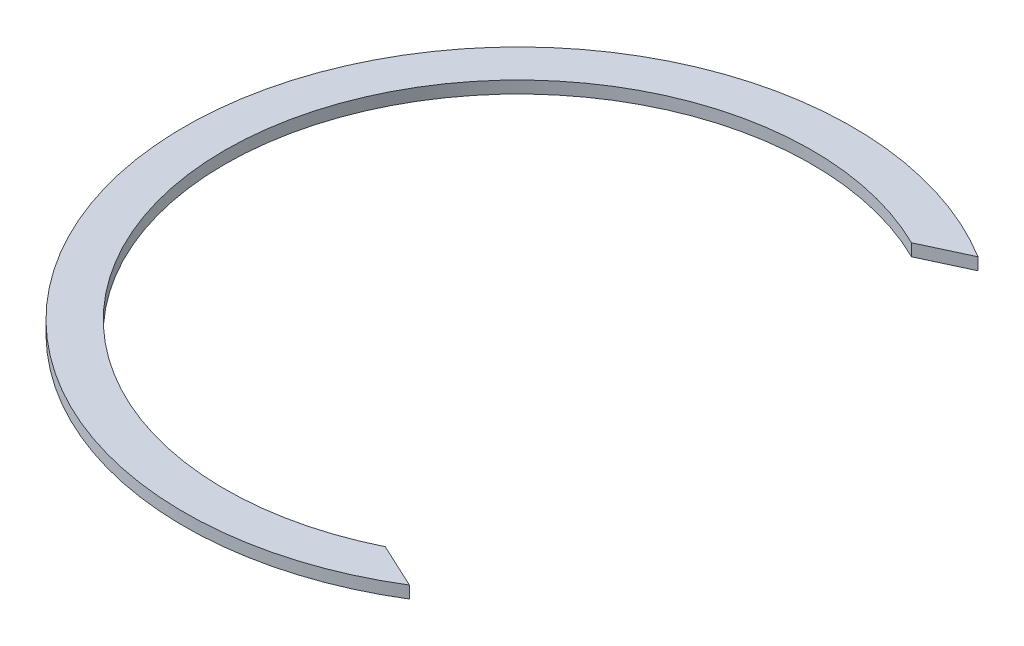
ISO-10303-21;
HEADER;
FILE_DESCRIPTION(('STEP AP214'),'2;1');
FILE_NAME('part.step','',(''),(''),'','','');
FILE_SCHEMA(('AUTOMOTIVE_DESIGN { 1 0 10303 214 1 1 1 1 }'));
ENDSEC;
DATA;
#1=APPLICATION_CONTEXT('core data for automotive mechanical design processes');
#2=APPLICATION_PROTOCOL_DEFINITION('international standard','automotive_design',2000,#1);
#3=PRODUCT_CONTEXT('',#1,'mechanical');
#4=PRODUCT('Part','Part','',(#3));
#5=PRODUCT_RELATED_PRODUCT_CATEGORY('part','',(#4));
#6=PRODUCT_DEFINITION_FORMATION('','',#4);
#7=PRODUCT_DEFINITION_CONTEXT('part definition',#1,'design');
#8=PRODUCT_DEFINITION('design','',#6,#7);
#9=PRODUCT_DEFINITION_SHAPE('','',#8);
#10=(LENGTH_UNIT() NAMED_UNIT(*) SI_UNIT(.MILLI.,.METRE.));
#11=(NAMED_UNIT(*) PLANE_ANGLE_UNIT() SI_UNIT($,.RADIAN.));
#12=(NAMED_UNIT(*) SI_UNIT($,.STERADIAN.) SOLID_ANGLE_UNIT());
#13=UNCERTAINTY_MEASURE_WITH_UNIT(LENGTH_MEASURE(1.E-05),#10,'distance_accuracy_value','');
#14=(GEOMETRIC_REPRESENTATION_CONTEXT(3) GLOBAL_UNCERTAINTY_ASSIGNED_CONTEXT((#13)) GLOBAL_UNIT_ASSIGNED_CONTEXT((#10,
#11,#12)) REPRESENTATION_CONTEXT('',''));
#15=CARTESIAN_POINT('',(0.,0.,0.));
#16=DIRECTION('',(0.,0.,1.));
#17=DIRECTION('',(1.,0.,0.));
#18=AXIS2_PLACEMENT_3D('',#15,#16,#17);
#19=CARTESIAN_POINT('',(0.,0.6,0.));
#20=DIRECTION('',(0.,1.,0.));
#21=DIRECTION('',(0.,0.,1.));
#22=AXIS2_PLACEMENT_3D('',#19,#20,#21);
#23=PLANE('',#22);
#24=DIRECTION('',(0.906307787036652,0.,0.422618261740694));
#25=VECTOR('',#24,1.);
#26=CARTESIAN_POINT('',(6.42261628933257,0.6,13.));
#27=LINE('',#26,#25);
#28=CARTESIAN_POINT('',(6.42261628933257,0.6,13.));
#29=VERTEX_POINT('',#28);
#30=CARTESIAN_POINT('',(8.66131064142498,0.6,14.043920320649));
#31=VERTEX_POINT('',#30);
#32=EDGE_CURVE('E80',#29,#31,#27,.T.);
#33=ORIENTED_EDGE('',*,*,#32,.F.);
#34=CARTESIAN_POINT('',(0.,0.6,0.));
#35=DIRECTION('',(0.,1.,0.));
#36=DIRECTION('',(0.,0.,1.));
#37=AXIS2_PLACEMENT_3D('',#34,#35,#36);
#38=CIRCLE('',#37,14.5);
#39=CARTESIAN_POINT('',(6.42261628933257,0.6,-13.));
#40=VERTEX_POINT('',#39);
#41=EDGE_CURVE('E91',#40,#29,#38,.T.);
#42=ORIENTED_EDGE('',*,*,#41,.F.);
#43=DIRECTION('',(-0.906307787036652,0.,0.422618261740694));
#44=VECTOR('',#43,1.);
#45=CARTESIAN_POINT('',(6.42261628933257,0.6,-13.));
#46=LINE('',#45,#44);
#47=CARTESIAN_POINT('',(8.66131064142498,0.6,-14.043920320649));
#48=VERTEX_POINT('',#47);
#49=EDGE_CURVE('E54',#48,#40,#46,.T.);
#50=ORIENTED_EDGE('',*,*,#49,.F.);
#51=CARTESIAN_POINT('',(0.,0.6,0.));
#52=DIRECTION('',(0.,1.,0.));
#53=DIRECTION('',(0.,0.,1.));
#54=AXIS2_PLACEMENT_3D('',#51,#52,#53);
#55=CIRCLE('',#54,16.5);
#56=EDGE_CURVE('E11',#48,#31,#55,.T.);
#57=ORIENTED_EDGE('',*,*,#56,.T.);
#58=EDGE_LOOP('',(#33,#42,#50,#57));
#59=FACE_BOUND('',#58,.T.);
#60=ADVANCED_FACE('F39',(#59),#23,.T.);
#61=CARTESIAN_POINT('',(0.,0.,0.));
#62=DIRECTION('',(0.,1.,0.));
#63=DIRECTION('',(0.,0.,1.));
#64=AXIS2_PLACEMENT_3D('',#61,#62,#63);
#65=PLANE('',#64);
#66=CARTESIAN_POINT('',(0.,0.,0.));
#67=DIRECTION('',(0.,1.,0.));
#68=DIRECTION('',(0.,0.,1.));
#69=AXIS2_PLACEMENT_3D('',#66,#67,#68);
#70=CIRCLE('',#69,14.5);
#71=CARTESIAN_POINT('',(6.42261628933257,0.,-13.));
#72=VERTEX_POINT('',#71);
#73=CARTESIAN_POINT('',(6.42261628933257,0.,13.));
#74=VERTEX_POINT('',#73);
#75=EDGE_CURVE('E95',#72,#74,#70,.T.);
#76=ORIENTED_EDGE('',*,*,#75,.T.);
#77=DIRECTION('',(0.906307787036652,0.,0.422618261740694));
#78=VECTOR('',#77,1.);
#79=CARTESIAN_POINT('',(6.42261628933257,0.,13.));
#80=LINE('',#79,#78);
#81=CARTESIAN_POINT('',(8.66131064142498,0.,14.043920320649));
#82=VERTEX_POINT('',#81);
#83=EDGE_CURVE('E62',#74,#82,#80,.T.);
#84=ORIENTED_EDGE('',*,*,#83,.T.);
#85=CARTESIAN_POINT('',(0.,0.,0.));
#86=DIRECTION('',(0.,1.,0.));
#87=DIRECTION('',(0.,0.,1.));
#88=AXIS2_PLACEMENT_3D('',#85,#86,#87);
#89=CIRCLE('',#88,16.5);
#90=CARTESIAN_POINT('',(8.66131064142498,0.,-14.043920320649));
#91=VERTEX_POINT('',#90);
#92=EDGE_CURVE('E43',#91,#82,#89,.T.);
#93=ORIENTED_EDGE('',*,*,#92,.F.);
#94=DIRECTION('',(-0.906307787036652,0.,0.422618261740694));
#95=VECTOR('',#94,1.);
#96=CARTESIAN_POINT('',(6.42261628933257,0.,-13.));
#97=LINE('',#96,#95);
#98=EDGE_CURVE('E102',#91,#72,#97,.T.);
#99=ORIENTED_EDGE('',*,*,#98,.T.);
#100=EDGE_LOOP('',(#76,#84,#93,#99));
#101=FACE_BOUND('',#100,.T.);
#102=ADVANCED_FACE('F111',(#101),#65,.F.);
#103=CARTESIAN_POINT('',(0.,0.6,0.));
#104=DIRECTION('',(0.,-1.,0.));
#105=DIRECTION('',(0.,0.,-1.));
#106=AXIS2_PLACEMENT_3D('',#103,#104,#105);
#107=CYLINDRICAL_SURFACE('',#106,16.5);
#108=ORIENTED_EDGE('',*,*,#92,.T.);
#109=DIRECTION('',(0.,-1.,0.));
#110=VECTOR('',#109,1.);
#111=CARTESIAN_POINT('',(8.66131064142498,0.6,14.043920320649));
#112=LINE('',#111,#110);
#113=EDGE_CURVE('E104',#82,#31,#112,.F.);
#114=ORIENTED_EDGE('',*,*,#113,.T.);
#115=ORIENTED_EDGE('',*,*,#56,.F.);
#116=DIRECTION('',(0.,-1.,0.));
#117=VECTOR('',#116,1.);
#118=CARTESIAN_POINT('',(8.66131064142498,0.6,-14.043920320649));
#119=LINE('',#118,#117);
#120=EDGE_CURVE('E87',#48,#91,#119,.T.);
#121=ORIENTED_EDGE('',*,*,#120,.T.);
#122=EDGE_LOOP('',(#108,#114,#115,#121));
#123=FACE_BOUND('',#122,.T.);
#124=ADVANCED_FACE('F41',(#123),#107,.T.);
#125=CARTESIAN_POINT('',(0.,0.,0.));
#126=DIRECTION('',(0.,1.,0.));
#127=DIRECTION('',(0.,0.,1.));
#128=AXIS2_PLACEMENT_3D('',#125,#126,#127);
#129=CYLINDRICAL_SURFACE('',#128,14.5);
#130=ORIENTED_EDGE('',*,*,#75,.F.);
#131=DIRECTION('',(0.,1.,0.));
#132=VECTOR('',#131,1.);
#133=CARTESIAN_POINT('',(6.42261628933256,0.,-13.));
#134=LINE('',#133,#132);
#135=EDGE_CURVE('E86',#72,#40,#134,.T.);
#136=ORIENTED_EDGE('',*,*,#135,.T.);
#137=ORIENTED_EDGE('',*,*,#41,.T.);
#138=DIRECTION('',(0.,1.,0.));
#139=VECTOR('',#138,1.);
#140=CARTESIAN_POINT('',(6.42261628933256,0.,13.));
#141=LINE('',#140,#139);
#142=EDGE_CURVE('E77',#74,#29,#141,.T.);
#143=ORIENTED_EDGE('',*,*,#142,.F.);
#144=EDGE_LOOP('',(#130,#136,#137,#143));
#145=FACE_BOUND('',#144,.T.);
#146=ADVANCED_FACE('F94',(#145),#129,.F.);
#147=CARTESIAN_POINT('',(6.42261628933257,0.,-13.));
#148=DIRECTION('',(-0.422618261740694,0.,-0.906307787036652));
#149=DIRECTION('',(-0.906307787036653,0.,0.422618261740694));
#150=AXIS2_PLACEMENT_3D('',#147,#148,#149);
#151=PLANE('',#150);
#152=ORIENTED_EDGE('',*,*,#49,.T.);
#153=ORIENTED_EDGE('',*,*,#135,.F.);
#154=ORIENTED_EDGE('',*,*,#98,.F.);
#155=ORIENTED_EDGE('',*,*,#120,.F.);
#156=EDGE_LOOP('',(#152,#153,#154,#155));
#157=FACE_BOUND('',#156,.T.);
#158=ADVANCED_FACE('F113',(#157),#151,.F.);
#159=CARTESIAN_POINT('',(6.42261628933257,0.,13.));
#160=DIRECTION('',(-0.422618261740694,0.,0.906307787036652));
#161=DIRECTION('',(0.906307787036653,0.,0.422618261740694));
#162=AXIS2_PLACEMENT_3D('',#159,#160,#161);
#163=PLANE('',#162);
#164=ORIENTED_EDGE('',*,*,#83,.F.);
#165=ORIENTED_EDGE('',*,*,#142,.T.);
#166=ORIENTED_EDGE('',*,*,#32,.T.);
#167=ORIENTED_EDGE('',*,*,#113,.F.);
#168=EDGE_LOOP('',(#164,#165,#166,#167));
#169=FACE_BOUND('',#168,.T.);
#170=ADVANCED_FACE('F79',(#169),#163,.F.);
#171=CLOSED_SHELL('',(#60,#102,#124,#146,#158,#170));
#172=MANIFOLD_SOLID_BREP('B2',#171);
#173=ADVANCED_BREP_SHAPE_REPRESENTATION('',(#18,#172),#14);
#174=SHAPE_DEFINITION_REPRESENTATION(#9,#173);
ENDSEC;
END-ISO-10303-21;
